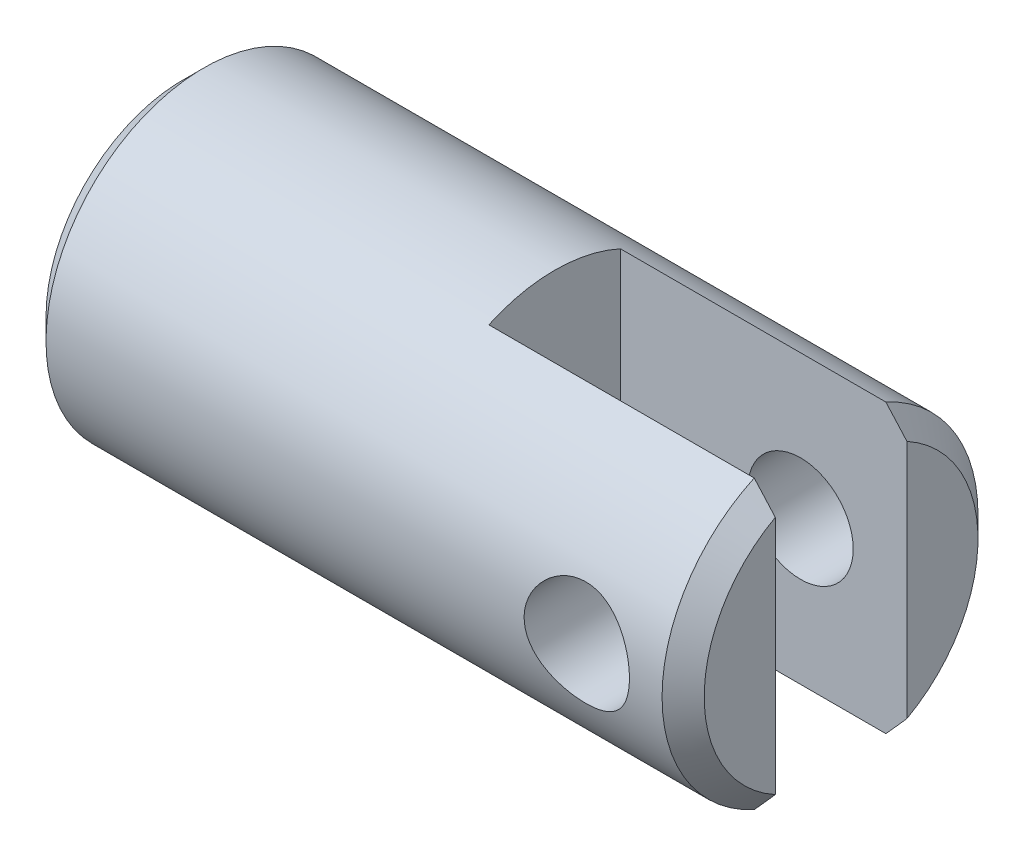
from build123d import *

# Parameters (mm, degrees)
SKETCH1_R               = 9.525
BASE_EXTRUDE_DEPTH      = 39.6875
CUT_EXTRUDE1_START      = -17.272
CUT_EXTRUDE1_DEPTH      = 17.272
CUT_EXTRUDE2_DEPTH      = 42.911202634
CUT_EXTRUDE2_DEPTH_BACK = 42.911202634
SKETCH3_R               = 3.175
CHAMFER1_SIZE           = 1.27


with BuildPart() as part:
    # Sketch1 → Base-Extrude (new body)
    with BuildSketch(Plane(origin=(0, 0, 0), x_dir=(0, 0, -1), z_dir=(1, 0, 0))):
        with Locations(Location((0, 0, 0), (0, 0, 180))):
            Circle(SKETCH1_R)
    extrude(amount=BASE_EXTRUDE_DEPTH)

    # Sketch2 → Cut-Extrude1 (cut)
    with BuildSketch(Plane(origin=(39.6875, 0, 0), x_dir=(0, 0, -1), z_dir=(1, 0, 0)).offset(CUT_EXTRUDE1_START)):
        with BuildLine():
            Line((-3.96875, 8.658790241), (-3.96875, -8.658790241))
            ThreePointArc((-3.96875, -8.658790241), (0, -9.525), (3.96875, -8.658790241))
            Line((3.96875, -8.658790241), (3.96875, 8.658790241))
            ThreePointArc((3.96875, 8.658790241), (0, 9.525), (-3.96875, 8.658790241))
        make_face()
    extrude(amount=CUT_EXTRUDE1_DEPTH, mode=Mode.SUBTRACT)

    # Sketch3 → Cut-Extrude2 (cut, two sides: drawn at the far end of the back side and taken through both)
    with BuildSketch(Plane.XY.offset(-CUT_EXTRUDE2_DEPTH_BACK)):
        with Locations((33.274, 0)):
            Circle(SKETCH3_R)
    extrude(amount=CUT_EXTRUDE2_DEPTH + CUT_EXTRUDE2_DEPTH_BACK, mode=Mode.SUBTRACT)

    # Chamfer1
    chamfer1_edges = [part.edges().sort_by_distance(p)[0] for p in [
        (0, 0, -9.525),
        (39.6875, -5.144087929, 8.016482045),
        (39.6875, 0, -9.525),
    ]]
    chamfer(chamfer1_edges, length=CHAMFER1_SIZE)


solid = part.part
